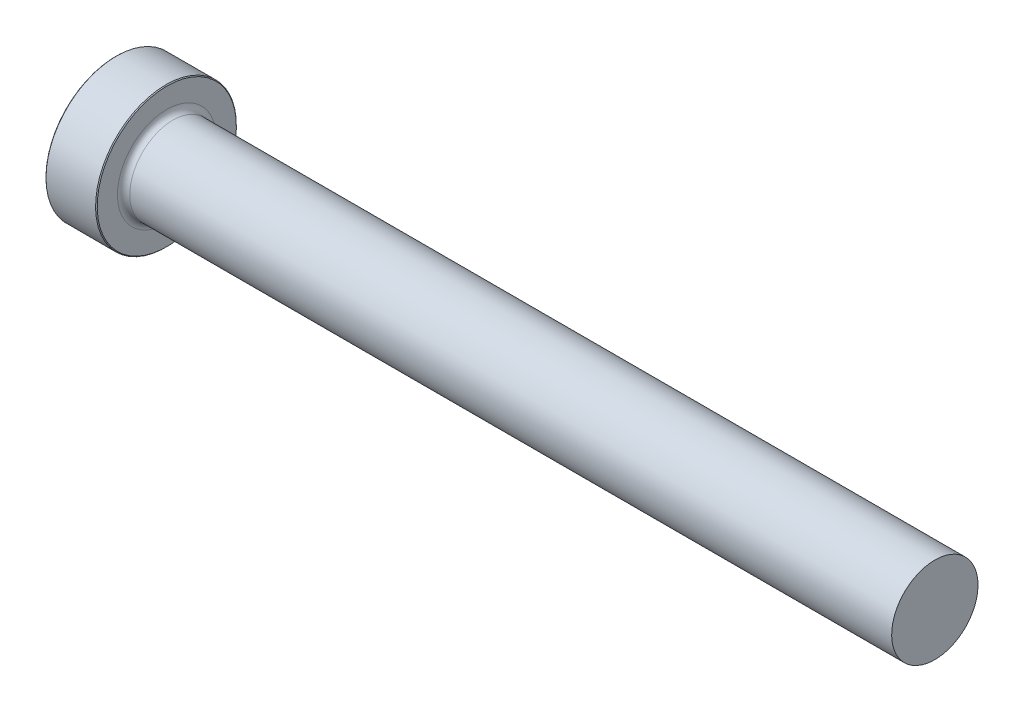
from build123d import *

# Parameters (mm, degrees)
CHAMFER1_SIZE = 0.1016


with BuildPart() as part:
    # Sketch1 → Revolve1 (revolve)
    with BuildSketch(Plane.XY):
        with BuildLine():
            Line((0, 0), (0, 8.73125))
            Line((0, 8.73125), (6.35, 8.73125))
            Line((6.35, 8.73125), (6.35, 6.1160025))
            ThreePointArc((6.35, 6.1160025), (6.573184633, 5.577187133), (7.112, 5.3540025))
            Line((7.112, 5.3540025), (101.6, 5.3540025))
            Line((101.6, 5.3540025), (101.6, 0))
            Line((101.6, 0), (0, 0))
        make_face()
    revolve(axis=Axis((101.6, 0, 0), (-1, 0, 0)))

    # Chamfer1
    chamfer1_edges = [part.edges().sort_by_distance(p)[0] for p in [
        (0, -8.73125, 0),
        (6.35, -8.73125, 0),
    ]]
    chamfer(chamfer1_edges, length=CHAMFER1_SIZE)


solid = part.part
